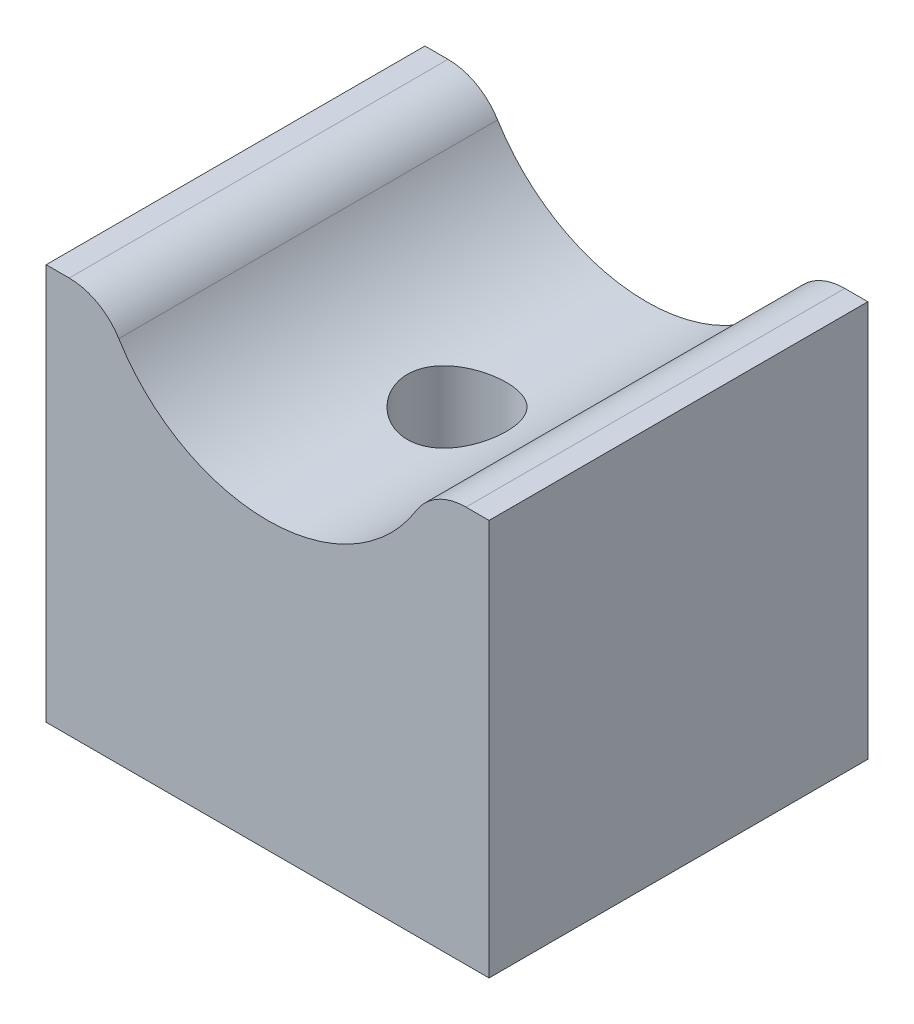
from build123d import *

# Parameters (mm, degrees)
AUFSATZ_LINEAR_AUSTRAGEN1_DEPTH                      = 16.25
VERRUNDUNG1_R                                        = 5
STIRNSENKUNG_F_R_M10_ZYLINDERSCHRAUBE_MI_D           = 8.5
STIRNSENKUNG_F_R_M10_ZYLINDERSCHRAUBE_MI_CBORE_D     = 15
STIRNSENKUNG_F_R_M10_ZYLINDERSCHRAUBE_MI_CBORE_DEPTH = 2


with BuildPart() as part:
    # Skizze1 → Aufsatz-Linear austragen1 (new, symmetric)
    with BuildSketch(Plane.XY):
        with BuildLine():
            Line((13.955285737, 34), (19, 34))
            Line((19, 34), (19, 0))
            Line((19, 0), (-19, 0))
            Line((-19, 0), (-19, 34))
            Line((-19, 34), (-13.955285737, 34))
            ThreePointArc((-13.955285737, 34), (0, 24.5), (13.955285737, 34))
        make_face()
    extrude(amount=AUFSATZ_LINEAR_AUSTRAGEN1_DEPTH, both=True)

    # Verrundung1
    verrundung1_edges = [part.edges().sort_by_distance(p)[0] for p in [
        (-13.955285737, 34, 0),
        (13.955285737, 34, 0),
    ]]
    fillet(verrundung1_edges, radius=VERRUNDUNG1_R)

    # Stirnsenkung f_r M10 Zylinderschraube mi (through all)
    with Locations(Plane.XZ):
        with Locations((0, 0)):
            CounterBoreHole(STIRNSENKUNG_F_R_M10_ZYLINDERSCHRAUBE_MI_D / 2, STIRNSENKUNG_F_R_M10_ZYLINDERSCHRAUBE_MI_CBORE_D / 2, STIRNSENKUNG_F_R_M10_ZYLINDERSCHRAUBE_MI_CBORE_DEPTH)


solid = part.part
